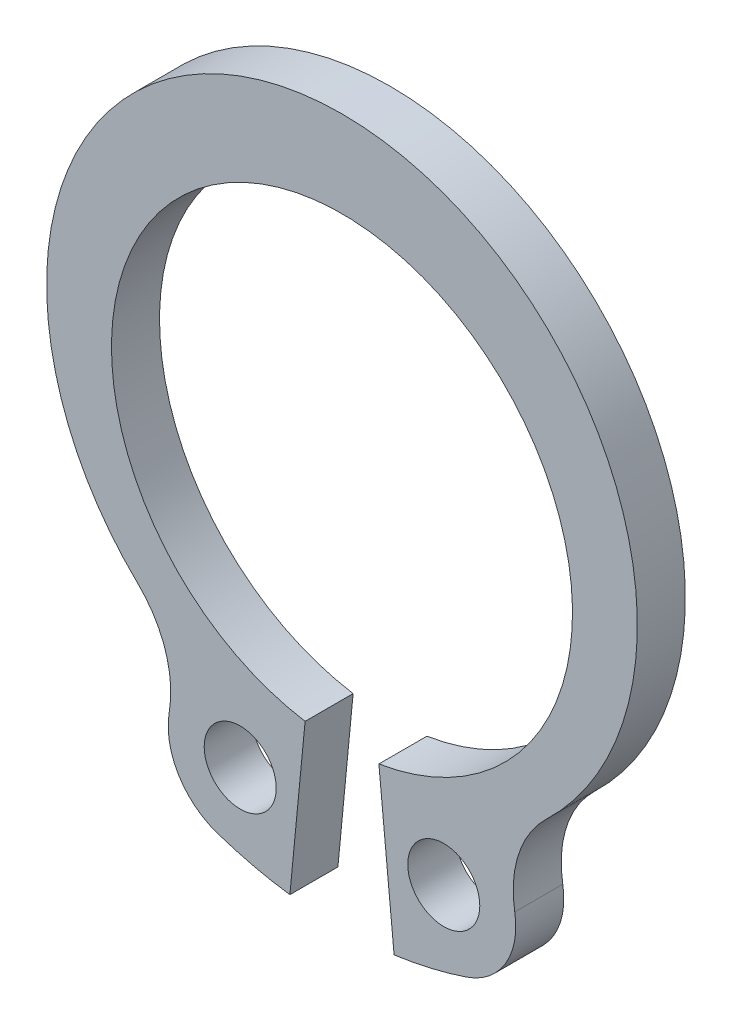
ISO-10303-21;
HEADER;
FILE_DESCRIPTION(('STEP AP214'),'2;1');
FILE_NAME('part.step','',(''),(''),'','','');
FILE_SCHEMA(('AUTOMOTIVE_DESIGN { 1 0 10303 214 1 1 1 1 }'));
ENDSEC;
DATA;
#1=APPLICATION_CONTEXT('core data for automotive mechanical design processes');
#2=APPLICATION_PROTOCOL_DEFINITION('international standard','automotive_design',2000,#1);
#3=PRODUCT_CONTEXT('',#1,'mechanical');
#4=PRODUCT('Part','Part','',(#3));
#5=PRODUCT_RELATED_PRODUCT_CATEGORY('part','',(#4));
#6=PRODUCT_DEFINITION_FORMATION('','',#4);
#7=PRODUCT_DEFINITION_CONTEXT('part definition',#1,'design');
#8=PRODUCT_DEFINITION('design','',#6,#7);
#9=PRODUCT_DEFINITION_SHAPE('','',#8);
#10=(LENGTH_UNIT() NAMED_UNIT(*) SI_UNIT(.MILLI.,.METRE.));
#11=(NAMED_UNIT(*) PLANE_ANGLE_UNIT() SI_UNIT($,.RADIAN.));
#12=(NAMED_UNIT(*) SI_UNIT($,.STERADIAN.) SOLID_ANGLE_UNIT());
#13=UNCERTAINTY_MEASURE_WITH_UNIT(LENGTH_MEASURE(1.E-05),#10,'distance_accuracy_value','');
#14=(GEOMETRIC_REPRESENTATION_CONTEXT(3) GLOBAL_UNCERTAINTY_ASSIGNED_CONTEXT((#13)) GLOBAL_UNIT_ASSIGNED_CONTEXT((#10,
#11,#12)) REPRESENTATION_CONTEXT('',''));
#15=CARTESIAN_POINT('',(0.,0.,0.));
#16=DIRECTION('',(0.,0.,1.));
#17=DIRECTION('',(1.,0.,0.));
#18=AXIS2_PLACEMENT_3D('',#15,#16,#17);
#19=CARTESIAN_POINT('',(0.,0.,1.));
#20=DIRECTION('',(0.,0.,1.));
#21=DIRECTION('',(1.,0.,0.));
#22=AXIS2_PLACEMENT_3D('',#19,#20,#21);
#23=PLANE('',#22);
#24=CARTESIAN_POINT('',(-2.11916198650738,-6.24622907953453,1.));
#25=DIRECTION('',(0.,0.,1.));
#26=DIRECTION('',(-1.,0.,0.));
#27=AXIS2_PLACEMENT_3D('',#24,#25,#26);
#28=CIRCLE('',#27,0.75);
#29=CARTESIAN_POINT('',(-2.86916198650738,-6.24622907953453,1.));
#30=VERTEX_POINT('',#29);
#31=EDGE_CURVE('E132',#30,#30,#28,.T.);
#32=ORIENTED_EDGE('',*,*,#31,.F.);
#33=EDGE_LOOP('',(#32));
#34=FACE_BOUND('',#33,.T.);
#35=CARTESIAN_POINT('',(0.,0.,1.));
#36=DIRECTION('',(0.,0.,-1.));
#37=DIRECTION('',(1.,0.,0.));
#38=AXIS2_PLACEMENT_3D('',#35,#36,#37);
#39=CIRCLE('',#38,4.8);
#40=CARTESIAN_POINT('',(-0.768130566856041,-4.7381405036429,1.));
#41=VERTEX_POINT('',#40);
#42=CARTESIAN_POINT('',(0.768130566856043,-4.7381405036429,1.));
#43=VERTEX_POINT('',#42);
#44=EDGE_CURVE('E154',#41,#43,#39,.T.);
#45=ORIENTED_EDGE('',*,*,#44,.T.);
#46=DIRECTION('',(0.0960091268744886,-0.995380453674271,0.));
#47=VECTOR('',#46,1.);
#48=CARTESIAN_POINT('',(0.768130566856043,-4.7381405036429,1.));
#49=LINE('',#48,#47);
#50=CARTESIAN_POINT('',(1.08496068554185,-8.022896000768,1.));
#51=VERTEX_POINT('',#50);
#52=EDGE_CURVE('E127',#43,#51,#49,.T.);
#53=ORIENTED_EDGE('',*,*,#52,.T.);
#54=CARTESIAN_POINT('',(0.,0.,1.));
#55=DIRECTION('',(0.,0.,1.));
#56=DIRECTION('',(1.,0.,0.));
#57=AXIS2_PLACEMENT_3D('',#54,#55,#56);
#58=CIRCLE('',#57,8.09592489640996);
#59=CARTESIAN_POINT('',(2.6010872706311,-7.66670365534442,1.));
#60=VERTEX_POINT('',#59);
#61=EDGE_CURVE('E157',#51,#60,#58,.T.);
#62=ORIENTED_EDGE('',*,*,#61,.T.);
#63=CARTESIAN_POINT('',(2.11916198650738,-6.24622907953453,1.));
#64=DIRECTION('',(0.,0.,1.));
#65=DIRECTION('',(1.,0.,0.));
#66=AXIS2_PLACEMENT_3D('',#63,#64,#65);
#67=CIRCLE('',#66,1.5);
#68=CARTESIAN_POINT('',(3.59753521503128,-5.99243271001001,1.));
#69=VERTEX_POINT('',#68);
#70=EDGE_CURVE('E159',#60,#69,#67,.T.);
#71=ORIENTED_EDGE('',*,*,#70,.T.);
#72=CARTESIAN_POINT('',(5.81509505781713,-5.61173815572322,1.));
#73=DIRECTION('',(0.,0.,-1.));
#74=DIRECTION('',(1.,0.,0.));
#75=AXIS2_PLACEMENT_3D('',#72,#73,#74);
#76=CIRCLE('',#75,2.25);
#77=CARTESIAN_POINT('',(4.25748031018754,-3.98805829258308,1.));
#78=VERTEX_POINT('',#77);
#79=EDGE_CURVE('E161',#69,#78,#76,.T.);
#80=ORIENTED_EDGE('',*,*,#79,.T.);
#81=CARTESIAN_POINT('',(0.,0.45,1.));
#82=DIRECTION('',(0.,0.,1.));
#83=DIRECTION('',(1.,0.,0.));
#84=AXIS2_PLACEMENT_3D('',#81,#82,#83);
#85=CIRCLE('',#84,6.15);
#86=CARTESIAN_POINT('',(-4.25748031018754,-3.98805829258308,1.));
#87=VERTEX_POINT('',#86);
#88=EDGE_CURVE('E163',#78,#87,#85,.T.);
#89=ORIENTED_EDGE('',*,*,#88,.T.);
#90=CARTESIAN_POINT('',(-5.81509505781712,-5.61173815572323,1.));
#91=DIRECTION('',(0.,0.,-1.));
#92=DIRECTION('',(-1.,0.,0.));
#93=AXIS2_PLACEMENT_3D('',#90,#91,#92);
#94=CIRCLE('',#93,2.25);
#95=CARTESIAN_POINT('',(-3.59753521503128,-5.99243271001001,1.));
#96=VERTEX_POINT('',#95);
#97=EDGE_CURVE('E165',#87,#96,#94,.T.);
#98=ORIENTED_EDGE('',*,*,#97,.T.);
#99=CARTESIAN_POINT('',(-2.11916198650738,-6.24622907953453,1.));
#100=DIRECTION('',(0.,0.,1.));
#101=DIRECTION('',(-1.,0.,0.));
#102=AXIS2_PLACEMENT_3D('',#99,#100,#101);
#103=CIRCLE('',#102,1.5);
#104=CARTESIAN_POINT('',(-2.6010872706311,-7.66670365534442,1.));
#105=VERTEX_POINT('',#104);
#106=EDGE_CURVE('E167',#96,#105,#103,.T.);
#107=ORIENTED_EDGE('',*,*,#106,.T.);
#108=CARTESIAN_POINT('',(0.,0.,1.));
#109=DIRECTION('',(0.,0.,1.));
#110=DIRECTION('',(-1.,0.,0.));
#111=AXIS2_PLACEMENT_3D('',#108,#109,#110);
#112=CIRCLE('',#111,8.09592489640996);
#113=CARTESIAN_POINT('',(-1.08496068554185,-8.022896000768,1.));
#114=VERTEX_POINT('',#113);
#115=EDGE_CURVE('E56',#105,#114,#112,.T.);
#116=ORIENTED_EDGE('',*,*,#115,.T.);
#117=DIRECTION('',(0.0960091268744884,0.995380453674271,0.));
#118=VECTOR('',#117,1.);
#119=CARTESIAN_POINT('',(-0.768130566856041,-4.7381405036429,1.));
#120=LINE('',#119,#118);
#121=EDGE_CURVE('E51',#114,#41,#120,.T.);
#122=ORIENTED_EDGE('',*,*,#121,.T.);
#123=EDGE_LOOP('',(#45,#53,#62,#71,#80,#89,#98,#107,#116,#122));
#124=FACE_BOUND('',#123,.T.);
#125=CARTESIAN_POINT('',(2.11916198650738,-6.24622907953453,1.));
#126=DIRECTION('',(0.,0.,1.));
#127=DIRECTION('',(1.,0.,0.));
#128=AXIS2_PLACEMENT_3D('',#125,#126,#127);
#129=CIRCLE('',#128,0.75);
#130=CARTESIAN_POINT('',(2.86916198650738,-6.24622907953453,1.));
#131=VERTEX_POINT('',#130);
#132=EDGE_CURVE('E254',#131,#131,#129,.T.);
#133=ORIENTED_EDGE('',*,*,#132,.F.);
#134=EDGE_LOOP('',(#133));
#135=FACE_BOUND('',#134,.T.);
#136=ADVANCED_FACE('F36',(#34,#124,#135),#23,.T.);
#137=CARTESIAN_POINT('',(0.,0.,0.));
#138=DIRECTION('',(0.,0.,1.));
#139=DIRECTION('',(1.,0.,0.));
#140=AXIS2_PLACEMENT_3D('',#137,#138,#139);
#141=PLANE('',#140);
#142=CARTESIAN_POINT('',(-2.11916198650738,-6.24622907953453,0.));
#143=DIRECTION('',(0.,0.,1.));
#144=DIRECTION('',(-1.,0.,0.));
#145=AXIS2_PLACEMENT_3D('',#142,#143,#144);
#146=CIRCLE('',#145,0.75);
#147=CARTESIAN_POINT('',(-2.86916198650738,-6.24622907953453,0.));
#148=VERTEX_POINT('',#147);
#149=EDGE_CURVE('E135',#148,#148,#146,.T.);
#150=ORIENTED_EDGE('',*,*,#149,.T.);
#151=EDGE_LOOP('',(#150));
#152=FACE_BOUND('',#151,.T.);
#153=CARTESIAN_POINT('',(0.,0.,0.));
#154=DIRECTION('',(0.,0.,-1.));
#155=DIRECTION('',(1.,0.,0.));
#156=AXIS2_PLACEMENT_3D('',#153,#154,#155);
#157=CIRCLE('',#156,4.8);
#158=CARTESIAN_POINT('',(-0.768130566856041,-4.7381405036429,0.));
#159=VERTEX_POINT('',#158);
#160=CARTESIAN_POINT('',(0.768130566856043,-4.7381405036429,0.));
#161=VERTEX_POINT('',#160);
#162=EDGE_CURVE('E118',#159,#161,#157,.T.);
#163=ORIENTED_EDGE('',*,*,#162,.F.);
#164=DIRECTION('',(0.0960091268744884,0.995380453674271,0.));
#165=VECTOR('',#164,1.);
#166=CARTESIAN_POINT('',(-0.768130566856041,-4.7381405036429,0.));
#167=LINE('',#166,#165);
#168=CARTESIAN_POINT('',(-1.08496068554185,-8.022896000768,0.));
#169=VERTEX_POINT('',#168);
#170=EDGE_CURVE('E152',#169,#159,#167,.T.);
#171=ORIENTED_EDGE('',*,*,#170,.F.);
#172=CARTESIAN_POINT('',(0.,0.,0.));
#173=DIRECTION('',(0.,0.,1.));
#174=DIRECTION('',(-1.,0.,0.));
#175=AXIS2_PLACEMENT_3D('',#172,#173,#174);
#176=CIRCLE('',#175,8.09592489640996);
#177=CARTESIAN_POINT('',(-2.6010872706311,-7.66670365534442,0.));
#178=VERTEX_POINT('',#177);
#179=EDGE_CURVE('E150',#178,#169,#176,.T.);
#180=ORIENTED_EDGE('',*,*,#179,.F.);
#181=CARTESIAN_POINT('',(-2.11916198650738,-6.24622907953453,0.));
#182=DIRECTION('',(0.,0.,1.));
#183=DIRECTION('',(-1.,0.,0.));
#184=AXIS2_PLACEMENT_3D('',#181,#182,#183);
#185=CIRCLE('',#184,1.5);
#186=CARTESIAN_POINT('',(-3.59753521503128,-5.99243271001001,0.));
#187=VERTEX_POINT('',#186);
#188=EDGE_CURVE('E148',#187,#178,#185,.T.);
#189=ORIENTED_EDGE('',*,*,#188,.F.);
#190=CARTESIAN_POINT('',(-5.81509505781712,-5.61173815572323,0.));
#191=DIRECTION('',(0.,0.,-1.));
#192=DIRECTION('',(-1.,0.,0.));
#193=AXIS2_PLACEMENT_3D('',#190,#191,#192);
#194=CIRCLE('',#193,2.25);
#195=CARTESIAN_POINT('',(-4.25748031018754,-3.98805829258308,0.));
#196=VERTEX_POINT('',#195);
#197=EDGE_CURVE('E146',#196,#187,#194,.T.);
#198=ORIENTED_EDGE('',*,*,#197,.F.);
#199=CARTESIAN_POINT('',(0.,0.45,0.));
#200=DIRECTION('',(0.,0.,1.));
#201=DIRECTION('',(1.,0.,0.));
#202=AXIS2_PLACEMENT_3D('',#199,#200,#201);
#203=CIRCLE('',#202,6.15);
#204=CARTESIAN_POINT('',(4.25748031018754,-3.98805829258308,0.));
#205=VERTEX_POINT('',#204);
#206=EDGE_CURVE('E144',#205,#196,#203,.T.);
#207=ORIENTED_EDGE('',*,*,#206,.F.);
#208=CARTESIAN_POINT('',(5.81509505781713,-5.61173815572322,0.));
#209=DIRECTION('',(0.,0.,-1.));
#210=DIRECTION('',(1.,0.,0.));
#211=AXIS2_PLACEMENT_3D('',#208,#209,#210);
#212=CIRCLE('',#211,2.25);
#213=CARTESIAN_POINT('',(3.59753521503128,-5.99243271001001,0.));
#214=VERTEX_POINT('',#213);
#215=EDGE_CURVE('E142',#214,#205,#212,.T.);
#216=ORIENTED_EDGE('',*,*,#215,.F.);
#217=CARTESIAN_POINT('',(2.11916198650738,-6.24622907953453,0.));
#218=DIRECTION('',(0.,0.,1.));
#219=DIRECTION('',(1.,0.,0.));
#220=AXIS2_PLACEMENT_3D('',#217,#218,#219);
#221=CIRCLE('',#220,1.5);
#222=CARTESIAN_POINT('',(2.6010872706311,-7.66670365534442,0.));
#223=VERTEX_POINT('',#222);
#224=EDGE_CURVE('E140',#223,#214,#221,.T.);
#225=ORIENTED_EDGE('',*,*,#224,.F.);
#226=CARTESIAN_POINT('',(0.,0.,0.));
#227=DIRECTION('',(0.,0.,1.));
#228=DIRECTION('',(1.,0.,0.));
#229=AXIS2_PLACEMENT_3D('',#226,#227,#228);
#230=CIRCLE('',#229,8.09592489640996);
#231=CARTESIAN_POINT('',(1.08496068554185,-8.022896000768,0.));
#232=VERTEX_POINT('',#231);
#233=EDGE_CURVE('E120',#232,#223,#230,.T.);
#234=ORIENTED_EDGE('',*,*,#233,.F.);
#235=DIRECTION('',(0.0960091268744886,-0.995380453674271,0.));
#236=VECTOR('',#235,1.);
#237=CARTESIAN_POINT('',(0.768130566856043,-4.7381405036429,0.));
#238=LINE('',#237,#236);
#239=EDGE_CURVE('E113',#161,#232,#238,.T.);
#240=ORIENTED_EDGE('',*,*,#239,.F.);
#241=EDGE_LOOP('',(#163,#171,#180,#189,#198,#207,#216,#225,#234,#240));
#242=FACE_BOUND('',#241,.T.);
#243=CARTESIAN_POINT('',(2.11916198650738,-6.24622907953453,0.));
#244=DIRECTION('',(0.,0.,1.));
#245=DIRECTION('',(1.,0.,0.));
#246=AXIS2_PLACEMENT_3D('',#243,#244,#245);
#247=CIRCLE('',#246,0.75);
#248=CARTESIAN_POINT('',(2.86916198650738,-6.24622907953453,0.));
#249=VERTEX_POINT('',#248);
#250=EDGE_CURVE('E257',#249,#249,#247,.T.);
#251=ORIENTED_EDGE('',*,*,#250,.T.);
#252=EDGE_LOOP('',(#251));
#253=FACE_BOUND('',#252,.T.);
#254=ADVANCED_FACE('F114',(#152,#242,#253),#141,.F.);
#255=CARTESIAN_POINT('',(0.,0.,1.));
#256=DIRECTION('',(0.,0.,-1.));
#257=DIRECTION('',(-1.,0.,0.));
#258=AXIS2_PLACEMENT_3D('',#255,#256,#257);
#259=CYLINDRICAL_SURFACE('',#258,4.8);
#260=ORIENTED_EDGE('',*,*,#162,.T.);
#261=DIRECTION('',(0.,0.,-1.));
#262=VECTOR('',#261,1.);
#263=CARTESIAN_POINT('',(0.768130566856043,-4.7381405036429,1.));
#264=LINE('',#263,#262);
#265=EDGE_CURVE('E11',#43,#161,#264,.T.);
#266=ORIENTED_EDGE('',*,*,#265,.F.);
#267=ORIENTED_EDGE('',*,*,#44,.F.);
#268=DIRECTION('',(0.,0.,-1.));
#269=VECTOR('',#268,1.);
#270=CARTESIAN_POINT('',(-0.768130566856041,-4.7381405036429,1.));
#271=LINE('',#270,#269);
#272=EDGE_CURVE('E131',#41,#159,#271,.T.);
#273=ORIENTED_EDGE('',*,*,#272,.T.);
#274=EDGE_LOOP('',(#260,#266,#267,#273));
#275=FACE_BOUND('',#274,.T.);
#276=ADVANCED_FACE('F38',(#275),#259,.F.);
#277=CARTESIAN_POINT('',(0.768130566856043,-4.7381405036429,1.));
#278=DIRECTION('',(0.995380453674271,0.0960091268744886,0.));
#279=DIRECTION('',(-0.0960091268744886,0.995380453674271,0.));
#280=AXIS2_PLACEMENT_3D('',#277,#278,#279);
#281=PLANE('',#280);
#282=ORIENTED_EDGE('',*,*,#239,.T.);
#283=DIRECTION('',(0.,0.,-1.));
#284=VECTOR('',#283,1.);
#285=CARTESIAN_POINT('',(1.08496068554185,-8.022896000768,1.));
#286=LINE('',#285,#284);
#287=EDGE_CURVE('E44',#51,#232,#286,.T.);
#288=ORIENTED_EDGE('',*,*,#287,.F.);
#289=ORIENTED_EDGE('',*,*,#52,.F.);
#290=ORIENTED_EDGE('',*,*,#265,.T.);
#291=EDGE_LOOP('',(#282,#288,#289,#290));
#292=FACE_BOUND('',#291,.T.);
#293=ADVANCED_FACE('F126',(#292),#281,.F.);
#294=CARTESIAN_POINT('',(0.,0.,1.));
#295=DIRECTION('',(0.,0.,-1.));
#296=DIRECTION('',(-1.,0.,0.));
#297=AXIS2_PLACEMENT_3D('',#294,#295,#296);
#298=CYLINDRICAL_SURFACE('',#297,8.09592489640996);
#299=ORIENTED_EDGE('',*,*,#233,.T.);
#300=DIRECTION('',(0.,0.,-1.));
#301=VECTOR('',#300,1.);
#302=CARTESIAN_POINT('',(2.6010872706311,-7.66670365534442,1.));
#303=LINE('',#302,#301);
#304=EDGE_CURVE('E190',#60,#223,#303,.T.);
#305=ORIENTED_EDGE('',*,*,#304,.F.);
#306=ORIENTED_EDGE('',*,*,#61,.F.);
#307=ORIENTED_EDGE('',*,*,#287,.T.);
#308=EDGE_LOOP('',(#299,#305,#306,#307));
#309=FACE_BOUND('',#308,.T.);
#310=ADVANCED_FACE('F194',(#309),#298,.T.);
#311=CARTESIAN_POINT('',(2.11916198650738,-6.24622907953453,1.));
#312=DIRECTION('',(0.,0.,-1.));
#313=DIRECTION('',(-1.,0.,0.));
#314=AXIS2_PLACEMENT_3D('',#311,#312,#313);
#315=CYLINDRICAL_SURFACE('',#314,1.5);
#316=ORIENTED_EDGE('',*,*,#224,.T.);
#317=DIRECTION('',(0.,0.,-1.));
#318=VECTOR('',#317,1.);
#319=CARTESIAN_POINT('',(3.59753521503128,-5.99243271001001,1.));
#320=LINE('',#319,#318);
#321=EDGE_CURVE('E187',#69,#214,#320,.T.);
#322=ORIENTED_EDGE('',*,*,#321,.F.);
#323=ORIENTED_EDGE('',*,*,#70,.F.);
#324=ORIENTED_EDGE('',*,*,#304,.T.);
#325=EDGE_LOOP('',(#316,#322,#323,#324));
#326=FACE_BOUND('',#325,.T.);
#327=ADVANCED_FACE('F202',(#326),#315,.T.);
#328=CARTESIAN_POINT('',(5.81509505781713,-5.61173815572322,1.));
#329=DIRECTION('',(0.,0.,-1.));
#330=DIRECTION('',(-1.,0.,0.));
#331=AXIS2_PLACEMENT_3D('',#328,#329,#330);
#332=CYLINDRICAL_SURFACE('',#331,2.25);
#333=ORIENTED_EDGE('',*,*,#215,.T.);
#334=DIRECTION('',(0.,0.,-1.));
#335=VECTOR('',#334,1.);
#336=CARTESIAN_POINT('',(4.25748031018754,-3.98805829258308,1.));
#337=LINE('',#336,#335);
#338=EDGE_CURVE('E184',#78,#205,#337,.T.);
#339=ORIENTED_EDGE('',*,*,#338,.F.);
#340=ORIENTED_EDGE('',*,*,#79,.F.);
#341=ORIENTED_EDGE('',*,*,#321,.T.);
#342=EDGE_LOOP('',(#333,#339,#340,#341));
#343=FACE_BOUND('',#342,.T.);
#344=ADVANCED_FACE('F205',(#343),#332,.F.);
#345=CARTESIAN_POINT('',(0.,0.45,1.));
#346=DIRECTION('',(0.,0.,-1.));
#347=DIRECTION('',(-1.,0.,0.));
#348=AXIS2_PLACEMENT_3D('',#345,#346,#347);
#349=CYLINDRICAL_SURFACE('',#348,6.15);
#350=ORIENTED_EDGE('',*,*,#206,.T.);
#351=DIRECTION('',(0.,0.,-1.));
#352=VECTOR('',#351,1.);
#353=CARTESIAN_POINT('',(-4.25748031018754,-3.98805829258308,1.));
#354=LINE('',#353,#352);
#355=EDGE_CURVE('E181',#87,#196,#354,.T.);
#356=ORIENTED_EDGE('',*,*,#355,.F.);
#357=ORIENTED_EDGE('',*,*,#88,.F.);
#358=ORIENTED_EDGE('',*,*,#338,.T.);
#359=EDGE_LOOP('',(#350,#356,#357,#358));
#360=FACE_BOUND('',#359,.T.);
#361=ADVANCED_FACE('F210',(#360),#349,.T.);
#362=CARTESIAN_POINT('',(-5.81509505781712,-5.61173815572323,1.));
#363=DIRECTION('',(0.,0.,-1.));
#364=DIRECTION('',(-1.,0.,0.));
#365=AXIS2_PLACEMENT_3D('',#362,#363,#364);
#366=CYLINDRICAL_SURFACE('',#365,2.25);
#367=ORIENTED_EDGE('',*,*,#197,.T.);
#368=DIRECTION('',(0.,0.,-1.));
#369=VECTOR('',#368,1.);
#370=CARTESIAN_POINT('',(-3.59753521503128,-5.99243271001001,1.));
#371=LINE('',#370,#369);
#372=EDGE_CURVE('E178',#96,#187,#371,.T.);
#373=ORIENTED_EDGE('',*,*,#372,.F.);
#374=ORIENTED_EDGE('',*,*,#97,.F.);
#375=ORIENTED_EDGE('',*,*,#355,.T.);
#376=EDGE_LOOP('',(#367,#373,#374,#375));
#377=FACE_BOUND('',#376,.T.);
#378=ADVANCED_FACE('F216',(#377),#366,.F.);
#379=CARTESIAN_POINT('',(-2.11916198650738,-6.24622907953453,1.));
#380=DIRECTION('',(0.,0.,-1.));
#381=DIRECTION('',(-1.,0.,0.));
#382=AXIS2_PLACEMENT_3D('',#379,#380,#381);
#383=CYLINDRICAL_SURFACE('',#382,1.5);
#384=ORIENTED_EDGE('',*,*,#188,.T.);
#385=DIRECTION('',(0.,0.,-1.));
#386=VECTOR('',#385,1.);
#387=CARTESIAN_POINT('',(-2.6010872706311,-7.66670365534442,1.));
#388=LINE('',#387,#386);
#389=EDGE_CURVE('E175',#105,#178,#388,.T.);
#390=ORIENTED_EDGE('',*,*,#389,.F.);
#391=ORIENTED_EDGE('',*,*,#106,.F.);
#392=ORIENTED_EDGE('',*,*,#372,.T.);
#393=EDGE_LOOP('',(#384,#390,#391,#392));
#394=FACE_BOUND('',#393,.T.);
#395=ADVANCED_FACE('F220',(#394),#383,.T.);
#396=CARTESIAN_POINT('',(0.,0.,1.));
#397=DIRECTION('',(0.,0.,-1.));
#398=DIRECTION('',(-1.,0.,0.));
#399=AXIS2_PLACEMENT_3D('',#396,#397,#398);
#400=CYLINDRICAL_SURFACE('',#399,8.09592489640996);
#401=ORIENTED_EDGE('',*,*,#179,.T.);
#402=DIRECTION('',(0.,0.,-1.));
#403=VECTOR('',#402,1.);
#404=CARTESIAN_POINT('',(-1.08496068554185,-8.022896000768,1.));
#405=LINE('',#404,#403);
#406=EDGE_CURVE('E172',#114,#169,#405,.T.);
#407=ORIENTED_EDGE('',*,*,#406,.F.);
#408=ORIENTED_EDGE('',*,*,#115,.F.);
#409=ORIENTED_EDGE('',*,*,#389,.T.);
#410=EDGE_LOOP('',(#401,#407,#408,#409));
#411=FACE_BOUND('',#410,.T.);
#412=ADVANCED_FACE('F223',(#411),#400,.T.);
#413=CARTESIAN_POINT('',(-0.768130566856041,-4.7381405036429,1.));
#414=DIRECTION('',(-0.995380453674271,0.0960091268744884,0.));
#415=DIRECTION('',(-0.0960091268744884,-0.995380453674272,0.));
#416=AXIS2_PLACEMENT_3D('',#413,#414,#415);
#417=PLANE('',#416);
#418=ORIENTED_EDGE('',*,*,#170,.T.);
#419=ORIENTED_EDGE('',*,*,#272,.F.);
#420=ORIENTED_EDGE('',*,*,#121,.F.);
#421=ORIENTED_EDGE('',*,*,#406,.T.);
#422=EDGE_LOOP('',(#418,#419,#420,#421));
#423=FACE_BOUND('',#422,.T.);
#424=ADVANCED_FACE('F225',(#423),#417,.F.);
#425=CARTESIAN_POINT('',(-2.11916198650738,-6.24622907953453,1.));
#426=DIRECTION('',(0.,0.,-1.));
#427=DIRECTION('',(-1.,0.,0.));
#428=AXIS2_PLACEMENT_3D('',#425,#426,#427);
#429=CYLINDRICAL_SURFACE('',#428,0.75);
#430=ORIENTED_EDGE('',*,*,#31,.T.);
#431=EDGE_LOOP('',(#430));
#432=FACE_BOUND('',#431,.T.);
#433=ORIENTED_EDGE('',*,*,#149,.F.);
#434=EDGE_LOOP('',(#433));
#435=FACE_BOUND('',#434,.T.);
#436=ADVANCED_FACE('F227',(#432,#435),#429,.F.);
#437=CARTESIAN_POINT('',(2.11916198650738,-6.24622907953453,1.));
#438=DIRECTION('',(0.,0.,-1.));
#439=DIRECTION('',(-1.,0.,0.));
#440=AXIS2_PLACEMENT_3D('',#437,#438,#439);
#441=CYLINDRICAL_SURFACE('',#440,0.75);
#442=ORIENTED_EDGE('',*,*,#132,.T.);
#443=EDGE_LOOP('',(#442));
#444=FACE_BOUND('',#443,.T.);
#445=ORIENTED_EDGE('',*,*,#250,.F.);
#446=EDGE_LOOP('',(#445));
#447=FACE_BOUND('',#446,.T.);
#448=ADVANCED_FACE('F233',(#444,#447),#441,.F.);
#449=CLOSED_SHELL('',(#136,#254,#276,#293,#310,#327,#344,#361,#378,#395,#412,#424,#436,#448));
#450=MANIFOLD_SOLID_BREP('B2',#449);
#451=ADVANCED_BREP_SHAPE_REPRESENTATION('',(#18,#450),#14);
#452=SHAPE_DEFINITION_REPRESENTATION(#9,#451);
ENDSEC;
END-ISO-10303-21;
